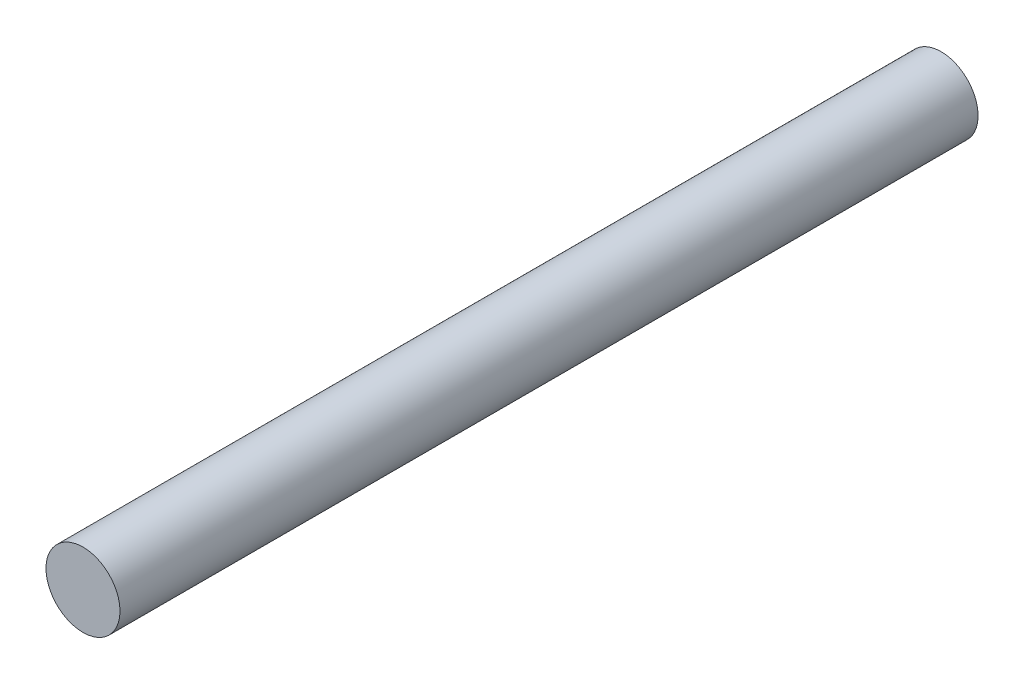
ISO-10303-21;
HEADER;
FILE_DESCRIPTION(('STEP AP214'),'2;1');
FILE_NAME('part.step','',(''),(''),'','','');
FILE_SCHEMA(('AUTOMOTIVE_DESIGN { 1 0 10303 214 1 1 1 1 }'));
ENDSEC;
DATA;
#1=APPLICATION_CONTEXT('core data for automotive mechanical design processes');
#2=APPLICATION_PROTOCOL_DEFINITION('international standard','automotive_design',2000,#1);
#3=PRODUCT_CONTEXT('',#1,'mechanical');
#4=PRODUCT('Part','Part','',(#3));
#5=PRODUCT_RELATED_PRODUCT_CATEGORY('part','',(#4));
#6=PRODUCT_DEFINITION_FORMATION('','',#4);
#7=PRODUCT_DEFINITION_CONTEXT('part definition',#1,'design');
#8=PRODUCT_DEFINITION('design','',#6,#7);
#9=PRODUCT_DEFINITION_SHAPE('','',#8);
#10=(LENGTH_UNIT() NAMED_UNIT(*) SI_UNIT(.MILLI.,.METRE.));
#11=(NAMED_UNIT(*) PLANE_ANGLE_UNIT() SI_UNIT($,.RADIAN.));
#12=(NAMED_UNIT(*) SI_UNIT($,.STERADIAN.) SOLID_ANGLE_UNIT());
#13=UNCERTAINTY_MEASURE_WITH_UNIT(LENGTH_MEASURE(1.E-05),#10,'distance_accuracy_value','');
#14=(GEOMETRIC_REPRESENTATION_CONTEXT(3) GLOBAL_UNCERTAINTY_ASSIGNED_CONTEXT((#13)) GLOBAL_UNIT_ASSIGNED_CONTEXT((#10,
#11,#12)) REPRESENTATION_CONTEXT('',''));
#15=CARTESIAN_POINT('',(0.,0.,0.));
#16=DIRECTION('',(0.,0.,1.));
#17=DIRECTION('',(1.,0.,0.));
#18=AXIS2_PLACEMENT_3D('',#15,#16,#17);
#19=CARTESIAN_POINT('',(0.,0.,29.));
#20=DIRECTION('',(0.,0.,-1.));
#21=DIRECTION('',(-1.,0.,0.));
#22=AXIS2_PLACEMENT_3D('',#19,#20,#21);
#23=CYLINDRICAL_SURFACE('',#22,1.25);
#24=CARTESIAN_POINT('',(0.,0.,29.));
#25=DIRECTION('',(0.,0.,1.));
#26=DIRECTION('',(1.,0.,0.));
#27=AXIS2_PLACEMENT_3D('',#24,#25,#26);
#28=CIRCLE('',#27,1.25);
#29=CARTESIAN_POINT('',(-1.25,0.,29.));
#30=VERTEX_POINT('',#29);
#31=EDGE_CURVE('E10',#30,#30,#28,.T.);
#32=CARTESIAN_POINT('',(0.,0.,0.));
#33=DIRECTION('',(0.,0.,1.));
#34=DIRECTION('',(1.,0.,0.));
#35=AXIS2_PLACEMENT_3D('',#32,#33,#34);
#36=CIRCLE('',#35,1.25);
#37=CARTESIAN_POINT('',(-1.25,0.,0.));
#38=VERTEX_POINT('',#37);
#39=EDGE_CURVE('E39',#38,#38,#36,.T.);
#40=CARTESIAN_POINT('',(-1.25,0.,29.));
#41=CARTESIAN_POINT('',(-1.25,0.,28.6979166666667));
#42=CARTESIAN_POINT('',(-1.25,0.,28.3958333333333));
#43=CARTESIAN_POINT('',(-1.25,0.,27.7916666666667));
#44=CARTESIAN_POINT('',(-1.25,0.,27.4895833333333));
#45=CARTESIAN_POINT('',(-1.25,0.,26.8854166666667));
#46=CARTESIAN_POINT('',(-1.25,0.,26.5833333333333));
#47=CARTESIAN_POINT('',(-1.25,0.,25.9791666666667));
#48=CARTESIAN_POINT('',(-1.25,0.,25.6770833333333));
#49=CARTESIAN_POINT('',(-1.25,0.,25.0729166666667));
#50=CARTESIAN_POINT('',(-1.25,0.,24.7708333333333));
#51=CARTESIAN_POINT('',(-1.25,0.,24.1666666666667));
#52=CARTESIAN_POINT('',(-1.25,0.,23.8645833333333));
#53=CARTESIAN_POINT('',(-1.25,0.,23.2604166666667));
#54=CARTESIAN_POINT('',(-1.25,0.,22.9583333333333));
#55=CARTESIAN_POINT('',(-1.25,0.,22.3541666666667));
#56=CARTESIAN_POINT('',(-1.25,0.,22.0520833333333));
#57=CARTESIAN_POINT('',(-1.25,0.,21.4479166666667));
#58=CARTESIAN_POINT('',(-1.25,0.,21.1458333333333));
#59=CARTESIAN_POINT('',(-1.25,0.,20.5416666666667));
#60=CARTESIAN_POINT('',(-1.25,0.,20.2395833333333));
#61=CARTESIAN_POINT('',(-1.25,0.,19.6354166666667));
#62=CARTESIAN_POINT('',(-1.25,0.,19.3333333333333));
#63=CARTESIAN_POINT('',(-1.25,0.,18.7291666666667));
#64=CARTESIAN_POINT('',(-1.25,0.,18.4270833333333));
#65=CARTESIAN_POINT('',(-1.25,0.,17.8229166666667));
#66=CARTESIAN_POINT('',(-1.25,0.,17.5208333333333));
#67=CARTESIAN_POINT('',(-1.25,0.,16.9166666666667));
#68=CARTESIAN_POINT('',(-1.25,0.,16.6145833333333));
#69=CARTESIAN_POINT('',(-1.25,0.,16.0104166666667));
#70=CARTESIAN_POINT('',(-1.25,0.,15.7083333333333));
#71=CARTESIAN_POINT('',(-1.25,0.,15.1041666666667));
#72=CARTESIAN_POINT('',(-1.25,0.,14.8020833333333));
#73=CARTESIAN_POINT('',(-1.25,0.,14.1979166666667));
#74=CARTESIAN_POINT('',(-1.25,0.,13.8958333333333));
#75=CARTESIAN_POINT('',(-1.25,0.,13.2916666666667));
#76=CARTESIAN_POINT('',(-1.25,0.,12.9895833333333));
#77=CARTESIAN_POINT('',(-1.25,0.,12.3854166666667));
#78=CARTESIAN_POINT('',(-1.25,0.,12.0833333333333));
#79=CARTESIAN_POINT('',(-1.25,0.,11.4791666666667));
#80=CARTESIAN_POINT('',(-1.25,0.,11.1770833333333));
#81=CARTESIAN_POINT('',(-1.25,0.,10.5729166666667));
#82=CARTESIAN_POINT('',(-1.25,0.,10.2708333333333));
#83=CARTESIAN_POINT('',(-1.25,0.,9.66666666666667));
#84=CARTESIAN_POINT('',(-1.25,0.,9.36458333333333));
#85=CARTESIAN_POINT('',(-1.25,0.,8.76041666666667));
#86=CARTESIAN_POINT('',(-1.25,0.,8.45833333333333));
#87=CARTESIAN_POINT('',(-1.25,0.,7.85416666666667));
#88=CARTESIAN_POINT('',(-1.25,0.,7.55208333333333));
#89=CARTESIAN_POINT('',(-1.25,0.,6.94791666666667));
#90=CARTESIAN_POINT('',(-1.25,0.,6.64583333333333));
#91=CARTESIAN_POINT('',(-1.25,0.,6.04166666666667));
#92=CARTESIAN_POINT('',(-1.25,0.,5.73958333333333));
#93=CARTESIAN_POINT('',(-1.25,0.,5.13541666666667));
#94=CARTESIAN_POINT('',(-1.25,0.,4.83333333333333));
#95=CARTESIAN_POINT('',(-1.25,0.,4.22916666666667));
#96=CARTESIAN_POINT('',(-1.25,0.,3.92708333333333));
#97=CARTESIAN_POINT('',(-1.25,0.,3.32291666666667));
#98=CARTESIAN_POINT('',(-1.25,0.,3.02083333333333));
#99=CARTESIAN_POINT('',(-1.25,0.,2.41666666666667));
#100=CARTESIAN_POINT('',(-1.25,0.,2.11458333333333));
#101=CARTESIAN_POINT('',(-1.25,0.,1.51041666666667));
#102=CARTESIAN_POINT('',(-1.25,0.,1.20833333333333));
#103=CARTESIAN_POINT('',(-1.25,0.,0.604166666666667));
#104=CARTESIAN_POINT('',(-1.25,0.,0.302083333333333));
#105=CARTESIAN_POINT('',(-1.25,0.,0.));
#106=B_SPLINE_CURVE_WITH_KNOTS('',3,(#40,#41,#42,#43,#44,#45,#46,#47,#48,#49,#50,#51,#52,#53,
#54,#55,#56,#57,#58,#59,#60,#61,#62,#63,#64,#65,#66,#67,#68,#69,#70,#71,#72,#73,#74,#75,#76,#77,
#78,#79,#80,#81,#82,#83,#84,#85,#86,#87,#88,#89,#90,#91,#92,#93,#94,#95,#96,#97,#98,#99,#100,
#101,#102,#103,#104,#105),.UNSPECIFIED.,.F.,.F.,(4,2,2,2,2,2,2,2,2,2,2,2,2,2,2,2,2,2,2,2,2,2,2,
2,2,2,2,2,2,2,2,2,4),(0.,0.906249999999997,1.8125,2.71875,3.625,4.53125,5.4375,6.34375,7.25,
8.15625,9.0625,9.96875,10.875,11.78125,12.6875,13.59375,14.5,15.40625,16.3125,17.21875,18.125,
19.03125,19.9375,20.84375,21.75,22.65625,23.5625,24.46875,25.375,26.28125,27.1875,28.09375,29.),.UNSPECIFIED.);
#107=EDGE_CURVE('BSEAM33',#30,#38,#106,.T.);
#108=ORIENTED_EDGE('',*,*,#31,.F.);
#109=ORIENTED_EDGE('',*,*,#39,.T.);
#110=ORIENTED_EDGE('',*,*,#107,.T.);
#111=ORIENTED_EDGE('',*,*,#107,.F.);
#112=EDGE_LOOP('',(#108,#110,#109,#111));
#113=FACE_BOUND('',#112,.T.);
#114=ADVANCED_FACE('F33',(#113),#23,.T.);
#115=CARTESIAN_POINT('',(0.,0.,29.));
#116=DIRECTION('',(0.,0.,1.));
#117=DIRECTION('',(1.,0.,0.));
#118=AXIS2_PLACEMENT_3D('',#115,#116,#117);
#119=PLANE('',#118);
#120=ORIENTED_EDGE('',*,*,#31,.T.);
#121=EDGE_LOOP('',(#120));
#122=FACE_BOUND('',#121,.T.);
#123=ADVANCED_FACE('F48',(#122),#119,.T.);
#124=CARTESIAN_POINT('',(0.,0.,0.));
#125=DIRECTION('',(0.,0.,1.));
#126=DIRECTION('',(1.,0.,0.));
#127=AXIS2_PLACEMENT_3D('',#124,#125,#126);
#128=PLANE('',#127);
#129=ORIENTED_EDGE('',*,*,#39,.F.);
#130=EDGE_LOOP('',(#129));
#131=FACE_BOUND('',#130,.T.);
#132=ADVANCED_FACE('F46',(#131),#128,.F.);
#133=CLOSED_SHELL('',(#114,#123,#132));
#134=MANIFOLD_SOLID_BREP('B2',#133);
#135=ADVANCED_BREP_SHAPE_REPRESENTATION('',(#18,#134),#14);
#136=SHAPE_DEFINITION_REPRESENTATION(#9,#135);
ENDSEC;
END-ISO-10303-21;
